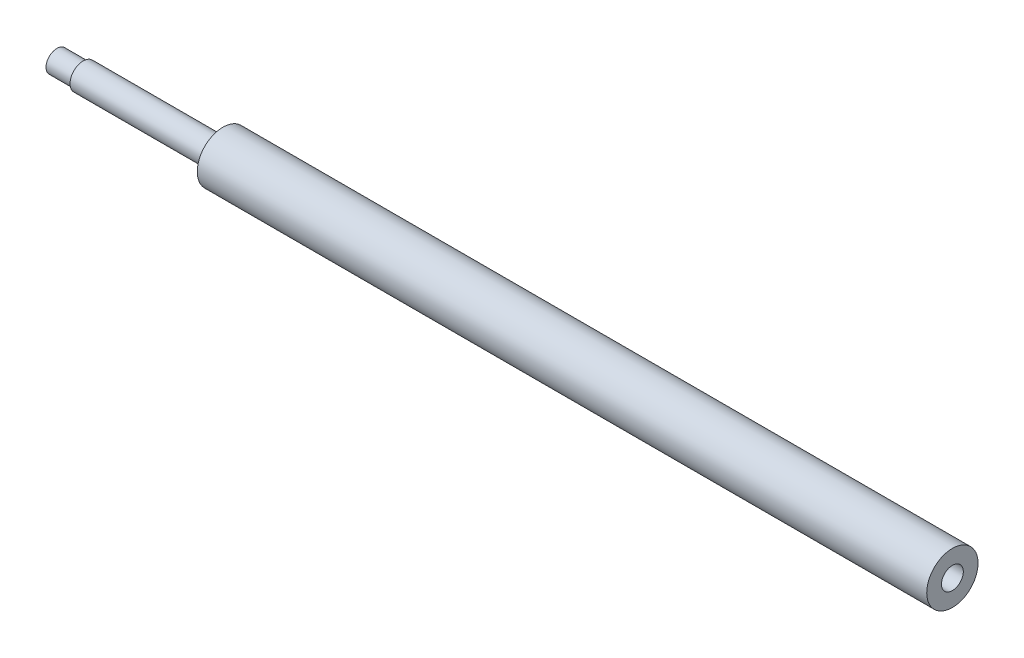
from build123d import *

# Parameters (mm, degrees)
PER_AGE1_D     = 5
PER_AGE1_DEPTH = 20
PER_AGE1_TIP   = 1.502151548


with BuildPart() as part:
    # Esquisse1 → Base-R_volution (revolve)
    with BuildSketch(Plane.XY, mode=Mode.PRIVATE) as base_r_volution_sk:
        Polygon((0, 0), (0, 2.5), (6, 2.5), (6, 3), (38, 3), (38, 5.875), (205, 5.875), (205, 0), align=None)
    revolve(base_r_volution_sk.sketch.rotate(Axis((0, 0, 0), (1, 0, 0)), 90), axis=Axis((0, 0, 0), (1, 0, 0)))

    # Per_age1
    with Locations(Plane(origin=(205, 0, 0), x_dir=(0, 0, -1), z_dir=(1, 0, 0))):
        with Locations((0, 0)):
            Hole(PER_AGE1_D / 2, depth=PER_AGE1_DEPTH)
            with Locations((0, 0, -(PER_AGE1_DEPTH + PER_AGE1_TIP / 2))):  # 118° drill point
                Cone(0, PER_AGE1_D / 2, PER_AGE1_TIP, mode=Mode.SUBTRACT)


solid = part.part
